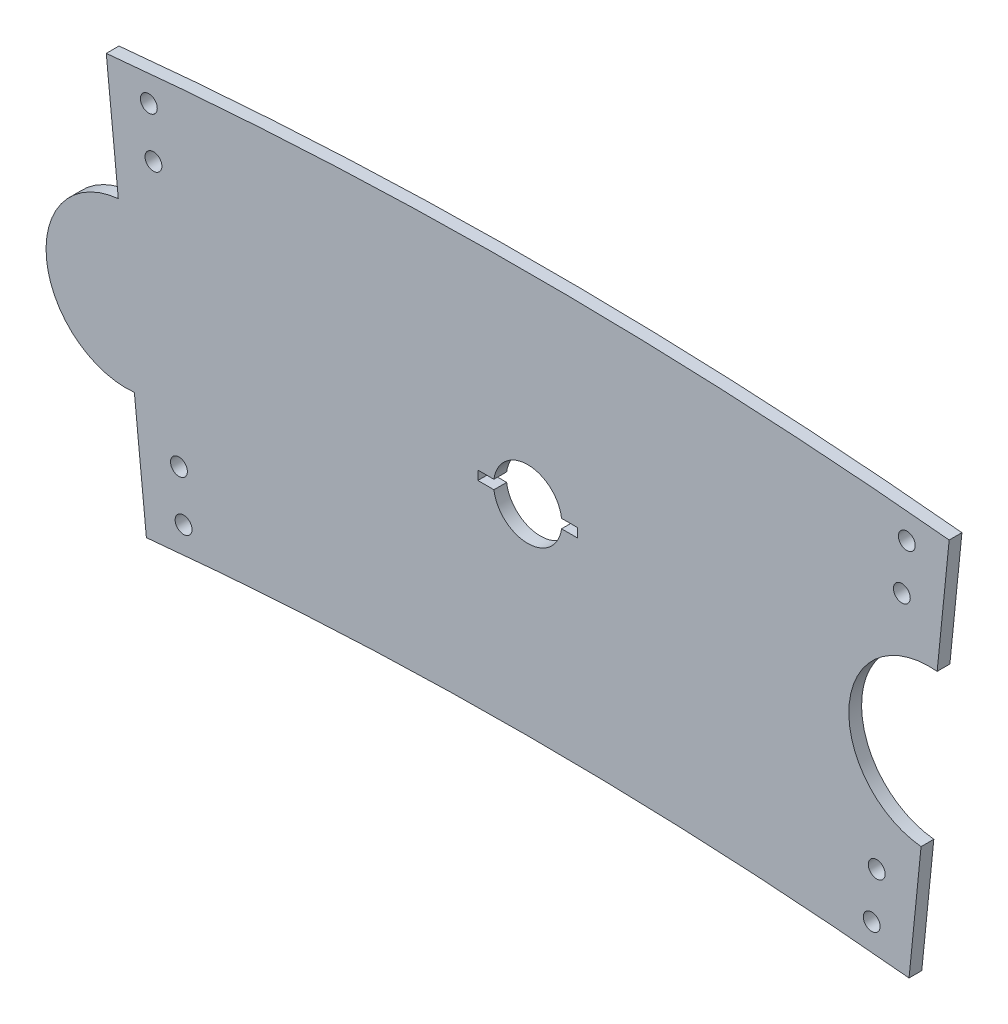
from build123d import *

# Parameters (mm, degrees)
BOSS_EXTRUDE1_DEPTH = 3.175
SKETCH3_R           = 2.1
CUT_EXTRUDE1_DEPTH  = 10


with BuildPart() as part:
    # Sketch1 → Boss-Extrude1 (new body)
    with BuildSketch(Plane.XY):
        with BuildLine():
            Line((-105, 44.736808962), (-102, 14.887185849))
            ThreePointArc((-102, 14.887185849), (-119.899748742, -7.012562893), (-98, -24.912311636))
            Line((-98, -24.912311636), (-95, -54.761934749))
            ThreePointArc((-95, -54.761934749), (0, -50), (95, -54.761934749))
            Line((95, -54.761934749), (98, -24.912311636))
            ThreePointArc((98, -24.912311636), (80.100251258, -3.012562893), (102, 14.887185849))
            Line((102, 14.887185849), (105, 44.736808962))
            ThreePointArc((105, 44.736808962), (0, 50), (-105, 44.736808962))
        make_face()
        with BuildLine():
            Line((-12.425222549, 1.125), (-8.425222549, 1.125))
            ThreePointArc((-8.425222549, 1.125), (0, 8.5), (8.425222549, 1.125))
            Line((8.425222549, 1.125), (12.425222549, 1.125))
            Line((12.425222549, 1.125), (12.425222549, -1.125))
            Line((12.425222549, -1.125), (8.425222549, -1.125))
            ThreePointArc((8.425222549, -1.125), (0, -8.5), (-8.425222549, -1.125))
            Line((-8.425222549, -1.125), (-12.425222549, -1.125))
            Line((-12.425222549, -1.125), (-12.425222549, 1.125))
        make_face(mode=Mode.SUBTRACT)
    extrude(amount=BOSS_EXTRUDE1_DEPTH)

    # Sketch3 → Cut-Extrude1 (cut)
    with BuildSketch(Plane.XY.offset(3.175)):
        with Locations((-94.396840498, 39.233865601)):
            Circle(SKETCH3_R)
        with Locations((-93.239490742, 27.289806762)):
            Circle(SKETCH3_R)
        with Locations((-86.896840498, -35.390192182)):
            Circle(SKETCH3_R)
        with Locations((-85.739490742, -47.334251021)):
            Circle(SKETCH3_R)
        with Locations((85.70397559, -47.259048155)):
            Circle(SKETCH3_R)
        with Locations((86.946610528, -35.3235608)):
            Circle(SKETCH3_R)
        with Locations((93.20397559, 27.365009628)):
            Circle(SKETCH3_R)
        with Locations((94.446610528, 39.300496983)):
            Circle(SKETCH3_R)
    extrude(amount=-CUT_EXTRUDE1_DEPTH, mode=Mode.SUBTRACT)


solid = part.part
